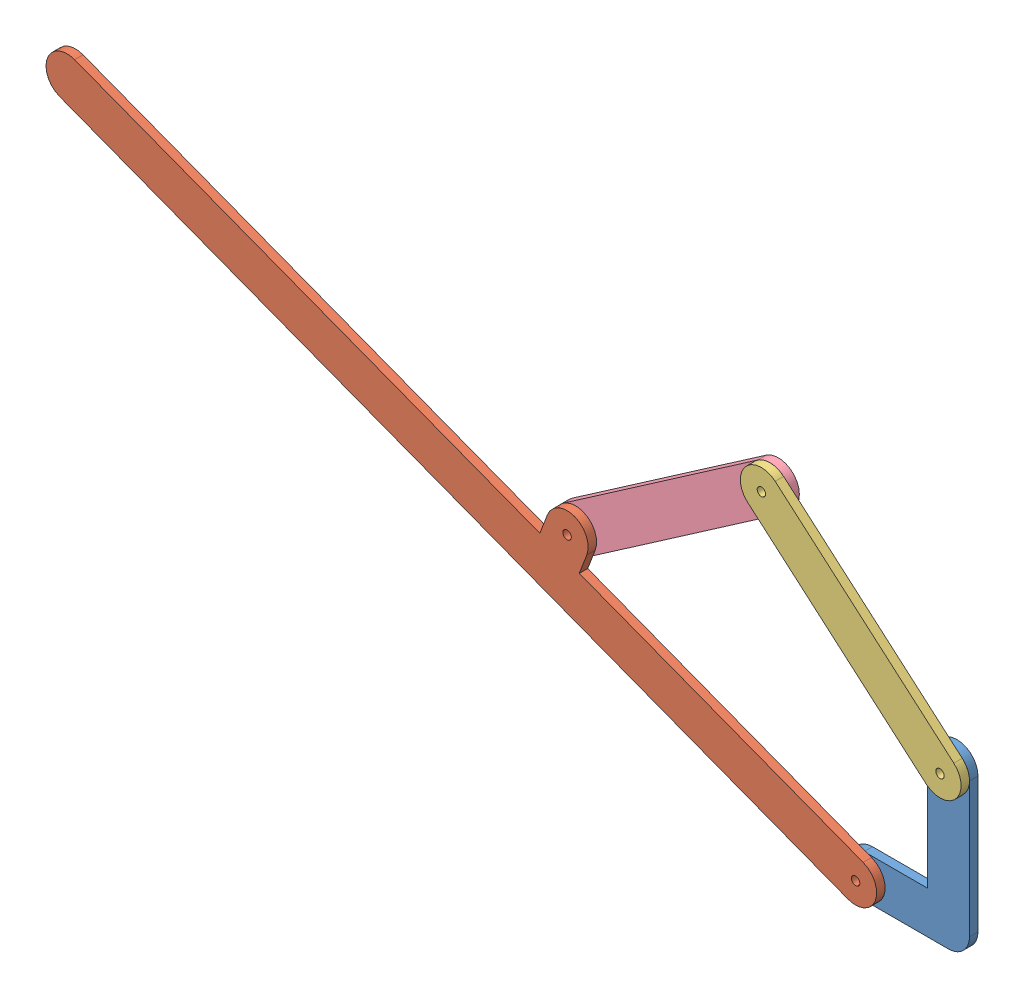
SolidWorks assembly Portail.SLDASM, configuration Défaut (file format 11000). Lengths in mm.
Overall size (1101.82 467.79 20).
4 component instances, 4 part files, 8 mates.
Components (placement in the parent):
- Bati-1: Bati.SLDPRT [Défaut] at (21.1806 -80.2324 205) size (150 210 10)
- portail-1: portail.SLDPRT [Défaut] at (-78.8194 -80.2324 225) x (-0.934282 0.356535 0) z (0 0 -1) size (1050 100 10)
- Bielle1-1: Bielle1.SLDPRT [Défaut] at (-190.4569 263.0967 215) x (0.755848 -0.654747 0) z (0 0 1) size (330 50 10)
- Bielle2-1: Bielle2.SLDPRT [Défaut] at (-420.6912 103.7475 205) x (0.822266 0.569104 0) z (0 0 1) size (330 50 10)
Mates (geometry in assembly coordinates):
- Coïncidente1: coincident: plane of Bati-1 through (21.1806 -80.2324 215) normal (0 0 1); plane of portail-1 through (-78.8194 -80.2324 215) normal (0 0 -1)
- Coaxiale1: concentric: cylinder of Bati-1 through (-78.8194 -80.2324 205) axis (0 0 1) radius 5; cylinder of portail-1 through (-78.8194 -80.2324 225) axis (0 0 -1) radius 5
- Coïncidente2: coincident: plane of Bati-1 through (21.1806 -80.2324 215) normal (0 0 1); plane of Bielle1-1 through (-190.4569 263.0967 215) normal (0 0 -1)
- Coaxiale2: concentric: cylinder of Bati-1 through (21.1806 79.7676 205) axis (0 0 1) radius 5; cylinder of Bielle1-1 through (21.1806 79.7676 215) axis (0 0 1) radius 5
- Coïncidente6: coincident: plane of Bielle1-1 through (-190.4569 263.0967 215) normal (0 0 -1); plane of Bielle2-1 through (-420.6912 103.7475 215) normal (0 0 1)
- Coaxiale3: concentric: cylinder of Bielle1-1 through (-190.4569 263.0967 215) axis (0 0 1) radius 5; cylinder of Bielle2-1 through (-190.4569 263.0967 205) axis (0 0 1) radius 5
- Coaxiale4: concentric: cylinder of portail-1 through (-420.6912 103.7475 225) axis (0 0 -1) radius 5; cylinder of Bielle2-1 through (-420.6912 103.7475 205) axis (0 0 1) radius 5
- Coïncidente5: coincident: plane of Bati-1 through (21.1806 -105.2324 215) normal (0 -1 0); plane of portail-1
